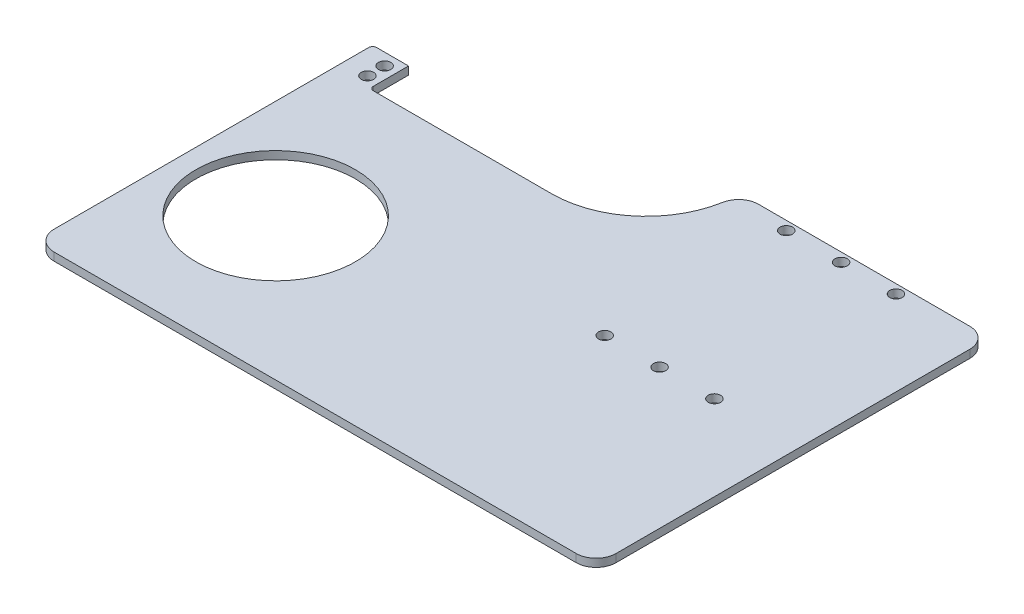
from build123d import *

# Parameters (mm, degrees)
ESBO_O1_W                = 400
ESBO_O1_H                = 250
RESSALTO_EXTRUS_O1_DEPTH = 4
ESBO_O4_W                = 400
ESBO_O4_H                = 250
CORTE_EXTRUS_O2_DEPTH    = 4
CORTE_EXTRUS_O3_REACH    = 268.596
ESBO_O5_R                = 3.1
ESBO_O5_R_2              = 40


with BuildPart() as part:
    # Esbo_o1 → Ressalto-extrus_o1 (new body)
    with BuildSketch(Plane(origin=(0, 0, 0), x_dir=(1, 0, 0), z_dir=(0, 1, 0))):
        with Locations((125, 25)):
            Rectangle(ESBO_O1_W, ESBO_O1_H)
    extrude(amount=RESSALTO_EXTRUS_O1_DEPTH)

    # Esbo_o4 → Corte-extrus_o2 (cut)
    with BuildSketch(Plane(origin=(0, 4, 0), x_dir=(1, 0, 0), z_dir=(0, 1, 0))):
        with Locations((125, 25)):
            Rectangle(ESBO_O4_W, ESBO_O4_H)
        with BuildLine():
            Line((-36.803769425, 112.32061), (-36.803769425, 94.7051))
            ThreePointArc((-36.803769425, 94.7051), (-36.217982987, 93.290886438), (-34.803769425, 92.7051))
            Line((-34.803769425, 92.7051), (54.547362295, 92.7051))
            ThreePointArc((54.547362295, 92.7051), (84.931609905, 103.756310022), (101.116326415, 131.745356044))
            ThreePointArc((101.116326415, 131.745356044), (104.538411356, 137.663340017), (110.962835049, 140))
            Line((110.962835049, 140), (216.842262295, 140))
            ThreePointArc((216.842262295, 140), (223.913330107, 137.071067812), (226.842262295, 130))
            Line((226.842262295, 130), (226.842262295, -47.2949))
            ThreePointArc((226.842262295, -47.2949), (223.913330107, -54.365967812), (216.842262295, -57.2949))
            Line((216.842262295, -57.2949), (-44.803769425, -57.2949))
            ThreePointArc((-44.803769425, -57.2949), (-51.874837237, -54.365967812), (-54.803769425, -47.2949))
            Line((-54.803769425, -47.2949), (-54.803769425, 110.32061))
            ThreePointArc((-54.803769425, 110.32061), (-54.217982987, 111.734823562), (-52.803769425, 112.32061))
            Line((-52.803769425, 112.32061), (-36.803769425, 112.32061))
        make_face(mode=Mode.SUBTRACT)
    extrude(amount=-CORTE_EXTRUS_O2_DEPTH, mode=Mode.SUBTRACT)

    # Esbo_o5 → Corte-extrus_o3 (cut, up to next)
    with BuildSketch(Plane(origin=(0, 4, 0), x_dir=(1, 0, 0), z_dir=(0, 1, 0)), mode=Mode.PRIVATE) as corte_extrus_o3_sk1:
        with Locations(Location((-42.803769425, 106.32061, 0), (0, 0, 270))):
            Circle(ESBO_O5_R)
    corte_extrus_o3_tool1 = extrude(corte_extrus_o3_sk1.sketch, amount=-CORTE_EXTRUS_O3_REACH, mode=Mode.PRIVATE) & part.part
    # Esbo_o5 → Corte-extrus_o3 (cut, up to next)
    with BuildSketch(Plane(origin=(0, 4, 0), x_dir=(1, 0, 0), z_dir=(0, 1, 0)), mode=Mode.PRIVATE) as corte_extrus_o3_sk2:
        with Locations(Location((-42.803769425, 97.72061, 0), (0, 0, 270))):
            Circle(ESBO_O5_R)
    corte_extrus_o3_tool2 = extrude(corte_extrus_o3_sk2.sketch, amount=-CORTE_EXTRUS_O3_REACH, mode=Mode.PRIVATE) & part.part
    # Esbo_o5 → Corte-extrus_o3 (cut, up to next)
    with BuildSketch(Plane(origin=(0, 4, 0), x_dir=(1, 0, 0), z_dir=(0, 1, 0)), mode=Mode.PRIVATE) as corte_extrus_o3_sk3:
        with Locations(Location((129.342262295, 135.5, 0), (0, 0, 270))):
            Circle(ESBO_O5_R)
    corte_extrus_o3_tool3 = extrude(corte_extrus_o3_sk3.sketch, amount=-CORTE_EXTRUS_O3_REACH, mode=Mode.PRIVATE) & part.part
    # Esbo_o5 → Corte-extrus_o3 (cut, up to next)
    with BuildSketch(Plane(origin=(0, 4, 0), x_dir=(1, 0, 0), z_dir=(0, 1, 0)), mode=Mode.PRIVATE) as corte_extrus_o3_sk4:
        with Locations(Location((156.842262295, 135.5, 0), (0, 0, 270))):
            Circle(ESBO_O5_R)
    corte_extrus_o3_tool4 = extrude(corte_extrus_o3_sk4.sketch, amount=-CORTE_EXTRUS_O3_REACH, mode=Mode.PRIVATE) & part.part
    # Esbo_o5 → Corte-extrus_o3 (cut, up to next)
    with BuildSketch(Plane(origin=(0, 4, 0), x_dir=(1, 0, 0), z_dir=(0, 1, 0)), mode=Mode.PRIVATE) as corte_extrus_o3_sk5:
        with Locations(Location((184.342262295, 135.5, 0), (0, 0, 270))):
            Circle(ESBO_O5_R)
    corte_extrus_o3_tool5 = extrude(corte_extrus_o3_sk5.sketch, amount=-CORTE_EXTRUS_O3_REACH, mode=Mode.PRIVATE) & part.part
    # Esbo_o5 → Corte-extrus_o3 (cut, up to next)
    with BuildSketch(Plane(origin=(0, 4, 0), x_dir=(1, 0, 0), z_dir=(0, 1, 0)), mode=Mode.PRIVATE) as corte_extrus_o3_sk6:
        with Locations(Location((184.342262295, 44.5, 0), (0, 0, 270))):
            Circle(ESBO_O5_R)
    corte_extrus_o3_tool6 = extrude(corte_extrus_o3_sk6.sketch, amount=-CORTE_EXTRUS_O3_REACH, mode=Mode.PRIVATE) & part.part
    # Esbo_o5 → Corte-extrus_o3 (cut, up to next)
    with BuildSketch(Plane(origin=(0, 4, 0), x_dir=(1, 0, 0), z_dir=(0, 1, 0)), mode=Mode.PRIVATE) as corte_extrus_o3_sk7:
        with Locations(Location((156.842262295, 44.5, 0), (0, 0, 270))):
            Circle(ESBO_O5_R)
    corte_extrus_o3_tool7 = extrude(corte_extrus_o3_sk7.sketch, amount=-CORTE_EXTRUS_O3_REACH, mode=Mode.PRIVATE) & part.part
    # Esbo_o5 → Corte-extrus_o3 (cut, up to next)
    with BuildSketch(Plane(origin=(0, 4, 0), x_dir=(1, 0, 0), z_dir=(0, 1, 0)), mode=Mode.PRIVATE) as corte_extrus_o3_sk8:
        with Locations(Location((129.342262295, 44.5, 0), (0, 0, 270))):
            Circle(ESBO_O5_R)
    corte_extrus_o3_tool8 = extrude(corte_extrus_o3_sk8.sketch, amount=-CORTE_EXTRUS_O3_REACH, mode=Mode.PRIVATE) & part.part
    # Esbo_o5 → Corte-extrus_o3 (cut, up to next)
    with BuildSketch(Plane(origin=(0, 4, 0), x_dir=(1, 0, 0), z_dir=(0, 1, 0)), mode=Mode.PRIVATE) as corte_extrus_o3_sk9:
        with Locations(Location((-5.103769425, 14, 0), (0, 0, 270))):
            Circle(ESBO_O5_R_2)
    corte_extrus_o3_tool9 = extrude(corte_extrus_o3_sk9.sketch, amount=-CORTE_EXTRUS_O3_REACH, mode=Mode.PRIVATE) & part.part
    add(corte_extrus_o3_tool1.solids().sort_by_distance((-42.803769, 4, -106.32061))[0], mode=Mode.SUBTRACT)
    add(corte_extrus_o3_tool2.solids().sort_by_distance((-42.803769, 4, -97.72061))[0], mode=Mode.SUBTRACT)
    add(corte_extrus_o3_tool3.solids().sort_by_distance((129.342262, 4, -135.5))[0], mode=Mode.SUBTRACT)
    add(corte_extrus_o3_tool4.solids().sort_by_distance((156.842262, 4, -135.5))[0], mode=Mode.SUBTRACT)
    add(corte_extrus_o3_tool5.solids().sort_by_distance((184.342262, 4, -135.5))[0], mode=Mode.SUBTRACT)
    add(corte_extrus_o3_tool6.solids().sort_by_distance((184.342262, 4, -44.5))[0], mode=Mode.SUBTRACT)
    add(corte_extrus_o3_tool7.solids().sort_by_distance((156.842262, 4, -44.5))[0], mode=Mode.SUBTRACT)
    add(corte_extrus_o3_tool8.solids().sort_by_distance((129.342262, 4, -44.5))[0], mode=Mode.SUBTRACT)
    add(corte_extrus_o3_tool9.solids().sort_by_distance((-5.103769, 4, -14))[0], mode=Mode.SUBTRACT)


solid = part.part
